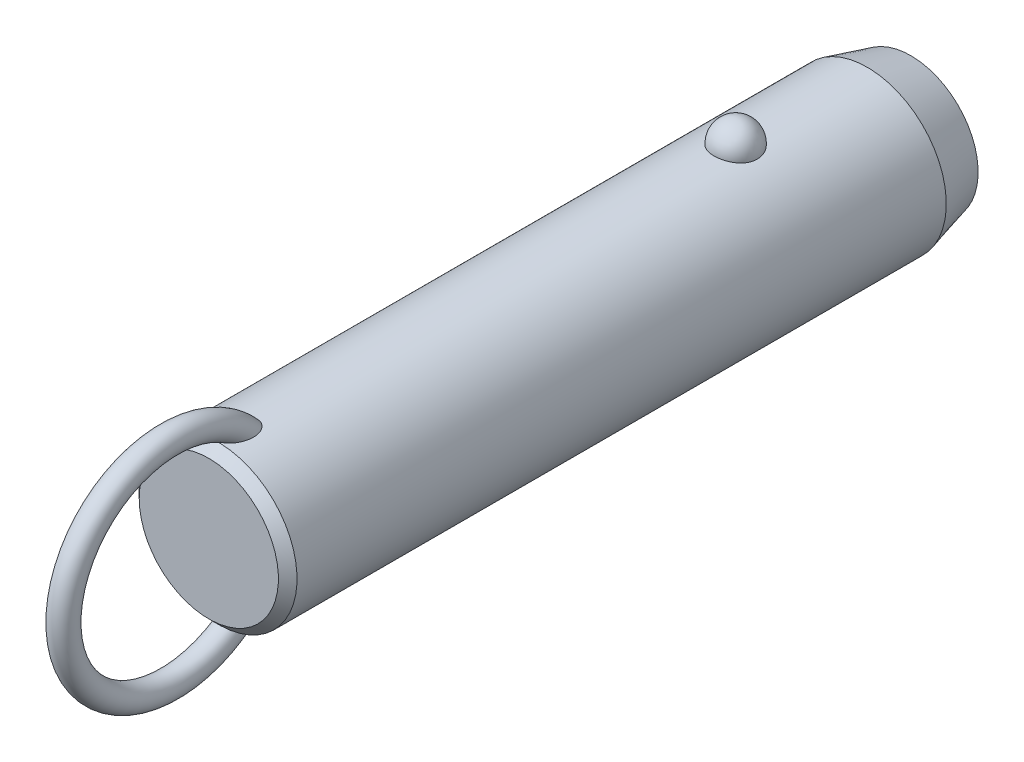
ISO-10303-21;
HEADER;
FILE_DESCRIPTION(('STEP AP214'),'2;1');
FILE_NAME('part.step','',(''),(''),'','','');
FILE_SCHEMA(('AUTOMOTIVE_DESIGN { 1 0 10303 214 1 1 1 1 }'));
ENDSEC;
DATA;
#1=APPLICATION_CONTEXT('core data for automotive mechanical design processes');
#2=APPLICATION_PROTOCOL_DEFINITION('international standard','automotive_design',2000,#1);
#3=PRODUCT_CONTEXT('',#1,'mechanical');
#4=PRODUCT('Part','Part','',(#3));
#5=PRODUCT_RELATED_PRODUCT_CATEGORY('part','',(#4));
#6=PRODUCT_DEFINITION_FORMATION('','',#4);
#7=PRODUCT_DEFINITION_CONTEXT('part definition',#1,'design');
#8=PRODUCT_DEFINITION('design','',#6,#7);
#9=PRODUCT_DEFINITION_SHAPE('','',#8);
#10=(LENGTH_UNIT() NAMED_UNIT(*) SI_UNIT(.MILLI.,.METRE.));
#11=(NAMED_UNIT(*) PLANE_ANGLE_UNIT() SI_UNIT($,.RADIAN.));
#12=(NAMED_UNIT(*) SI_UNIT($,.STERADIAN.) SOLID_ANGLE_UNIT());
#13=UNCERTAINTY_MEASURE_WITH_UNIT(LENGTH_MEASURE(1.E-05),#10,'distance_accuracy_value','');
#14=(GEOMETRIC_REPRESENTATION_CONTEXT(3) GLOBAL_UNCERTAINTY_ASSIGNED_CONTEXT((#13)) GLOBAL_UNIT_ASSIGNED_CONTEXT((#10,
#11,#12)) REPRESENTATION_CONTEXT('',''));
#15=CARTESIAN_POINT('',(0.,0.,0.));
#16=DIRECTION('',(0.,0.,1.));
#17=DIRECTION('',(1.,0.,0.));
#18=AXIS2_PLACEMENT_3D('',#15,#16,#17);
#19=CARTESIAN_POINT('',(0.,0.,68.6));
#20=DIRECTION('',(0.,0.,-1.));
#21=DIRECTION('',(-1.,0.,0.));
#22=AXIS2_PLACEMENT_3D('',#19,#20,#21);
#23=CYLINDRICAL_SURFACE('',#22,12.7);
#24=CARTESIAN_POINT('',(3.46661256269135,12.2177165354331,-3.5));
#25=CARTESIAN_POINT('',(3.4666090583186,12.2177194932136,-3.30432790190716));
#26=CARTESIAN_POINT('',(3.45063567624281,12.2222841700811,-3.10861112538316));
#27=CARTESIAN_POINT('',(3.38712451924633,12.2400345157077,-2.72271899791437));
#28=CARTESIAN_POINT('',(3.33957415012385,12.2532236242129,-2.53254588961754));
#29=CARTESIAN_POINT('',(3.2141234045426,12.286724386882,-2.16324948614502));
#30=CARTESIAN_POINT('',(3.13623639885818,12.3070329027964,-1.98412136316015));
#31=CARTESIAN_POINT('',(2.95205930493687,12.3525018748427,-1.64180592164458));
#32=CARTESIAN_POINT('',(2.84577003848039,12.3776621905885,-1.47861814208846));
#33=CARTESIAN_POINT('',(2.60688050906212,12.4301712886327,-1.17190583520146));
#34=CARTESIAN_POINT('',(2.47415697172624,12.4575299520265,-1.02847897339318));
#35=CARTESIAN_POINT('',(2.18615174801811,12.5112810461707,-0.766177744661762));
#36=CARTESIAN_POINT('',(2.03087002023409,12.5376734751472,-0.64730342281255));
#37=CARTESIAN_POINT('',(1.70237334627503,12.5864761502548,-0.437732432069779));
#38=CARTESIAN_POINT('',(1.52920948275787,12.6088972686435,-0.346958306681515));
#39=CARTESIAN_POINT('',(1.16944170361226,12.6473352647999,-0.195750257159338));
#40=CARTESIAN_POINT('',(0.982839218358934,12.663352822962,-0.135313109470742));
#41=CARTESIAN_POINT('',(0.604961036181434,12.6869706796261,-0.0473241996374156));
#42=CARTESIAN_POINT('',(0.41382314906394,12.6947125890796,-0.0192185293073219));
#43=CARTESIAN_POINT('',(0.0293827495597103,12.7014203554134,0.0051725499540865));
#44=CARTESIAN_POINT('',(-0.163919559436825,12.7003870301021,0.00146092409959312));
#45=CARTESIAN_POINT('',(-0.544374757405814,12.689735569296,-0.0373939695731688));
#46=CARTESIAN_POINT('',(-0.731575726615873,12.6802364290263,-0.0721015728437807));
#47=CARTESIAN_POINT('',(-1.09733277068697,12.6538333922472,-0.171364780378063));
#48=CARTESIAN_POINT('',(-1.27588869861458,12.6369293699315,-0.235920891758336));
#49=CARTESIAN_POINT('',(-1.6204698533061,12.5973946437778,-0.393548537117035));
#50=CARTESIAN_POINT('',(-1.78641865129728,12.5747321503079,-0.486778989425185));
#51=CARTESIAN_POINT('',(-2.10030671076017,12.5261316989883,-0.699110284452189));
#52=CARTESIAN_POINT('',(-2.24824419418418,12.5001934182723,-0.818213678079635));
#53=CARTESIAN_POINT('',(-2.52491489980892,12.4472906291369,-1.08157124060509));
#54=CARTESIAN_POINT('',(-2.65324222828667,12.4203160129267,-1.22624992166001));
#55=CARTESIAN_POINT('',(-2.88410007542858,12.3687509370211,-1.53528325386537));
#56=CARTESIAN_POINT('',(-2.98662883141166,12.3441606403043,-1.69963924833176));
#57=CARTESIAN_POINT('',(-3.16432417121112,12.2998199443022,-2.04548497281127));
#58=CARTESIAN_POINT('',(-3.23917525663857,12.2801261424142,-2.22714424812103));
#59=CARTESIAN_POINT('',(-3.35800573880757,12.248167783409,-2.6009138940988));
#60=CARTESIAN_POINT('',(-3.4019860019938,12.2359030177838,-2.79302397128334));
#61=CARTESIAN_POINT('',(-3.45784812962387,12.2202347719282,-3.18140279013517));
#62=CARTESIAN_POINT('',(-3.46986123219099,12.2167950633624,-3.37765118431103));
#63=CARTESIAN_POINT('',(-3.46186273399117,12.2190638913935,-3.76943689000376));
#64=CARTESIAN_POINT('',(-3.44185196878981,12.2247721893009,-3.96497421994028));
#65=CARTESIAN_POINT('',(-3.37048652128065,12.2446381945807,-4.34881728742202));
#66=CARTESIAN_POINT('',(-3.31928253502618,12.2587552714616,-4.53715319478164));
#67=CARTESIAN_POINT('',(-3.18693461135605,12.2938237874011,-4.90231727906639));
#68=CARTESIAN_POINT('',(-3.1057895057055,12.3147754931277,-5.07914500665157));
#69=CARTESIAN_POINT('',(-2.91506431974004,12.3613125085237,-5.41732059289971));
#70=CARTESIAN_POINT('',(-2.80533587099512,12.3869217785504,-5.57858147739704));
#71=CARTESIAN_POINT('',(-2.560414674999,12.4398525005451,-5.88013283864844));
#72=CARTESIAN_POINT('',(-2.42522099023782,12.4671740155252,-6.02042254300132));
#73=CARTESIAN_POINT('',(-2.1323357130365,12.5205965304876,-6.27662798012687));
#74=CARTESIAN_POINT('',(-1.97456596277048,12.5466928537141,-6.3924554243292));
#75=CARTESIAN_POINT('',(-1.64115839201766,12.5946384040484,-6.59583547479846));
#76=CARTESIAN_POINT('',(-1.46552179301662,12.6164879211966,-6.68339001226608));
#77=CARTESIAN_POINT('',(-1.10356050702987,12.6532533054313,-6.82682153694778));
#78=CARTESIAN_POINT('',(-0.9173913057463,12.6682500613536,-6.8830698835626));
#79=CARTESIAN_POINT('',(-0.537836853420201,12.6900288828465,-6.96386887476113));
#80=CARTESIAN_POINT('',(-0.344452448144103,12.6968119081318,-6.9884232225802));
#81=CARTESIAN_POINT('',(0.0402577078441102,12.7013667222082,-7.00496469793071));
#82=CARTESIAN_POINT('',(0.231556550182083,12.6993008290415,-6.99753844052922));
#83=CARTESIAN_POINT('',(0.610105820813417,12.6867505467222,-6.9516636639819));
#84=CARTESIAN_POINT('',(0.797356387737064,12.6762664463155,-6.913216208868));
#85=CARTESIAN_POINT('',(1.16186657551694,12.6480587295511,-6.80658431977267));
#86=CARTESIAN_POINT('',(1.33915951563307,12.6303611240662,-6.73850666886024));
#87=CARTESIAN_POINT('',(1.67968518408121,12.5896027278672,-6.5745087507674));
#88=CARTESIAN_POINT('',(1.84291705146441,12.5665416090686,-6.47858678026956));
#89=CARTESIAN_POINT('',(2.15340192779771,12.5171072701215,-6.25982455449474));
#90=CARTESIAN_POINT('',(2.30037831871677,12.4906895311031,-6.13660186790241));
#91=CARTESIAN_POINT('',(2.5717412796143,12.4376567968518,-5.86739587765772));
#92=CARTESIAN_POINT('',(2.69612388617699,12.4110417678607,-5.72140858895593));
#93=CARTESIAN_POINT('',(2.92107785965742,12.360051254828,-5.40794137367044));
#94=CARTESIAN_POINT('',(3.02121329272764,12.3357209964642,-5.24014110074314));
#95=CARTESIAN_POINT('',(3.19236291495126,12.2925446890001,-4.88969865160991));
#96=CARTESIAN_POINT('',(3.26338839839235,12.2736965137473,-4.70706226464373));
#97=CARTESIAN_POINT('',(3.36788038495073,12.245404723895,-4.35469510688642));
#98=CARTESIAN_POINT('',(3.40484026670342,12.2351018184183,-4.18605935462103));
#99=CARTESIAN_POINT('',(3.45420764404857,12.2212564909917,-3.84496058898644));
#100=CARTESIAN_POINT('',(3.46661565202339,12.2177139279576,-3.67249765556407));
#101=CARTESIAN_POINT('',(3.46661256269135,12.2177165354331,-3.5));
#102=B_SPLINE_CURVE_WITH_KNOTS('',3,(#24,#25,#26,#27,#28,#29,#30,#31,#32,#33,#34,#35,#36,#37,
#38,#39,#40,#41,#42,#43,#44,#45,#46,#47,#48,#49,#50,#51,#52,#53,#54,#55,#56,#57,#58,#59,#60,#61,
#62,#63,#64,#65,#66,#67,#68,#69,#70,#71,#72,#73,#74,#75,#76,#77,#78,#79,#80,#81,#82,#83,#84,#85,
#86,#87,#88,#89,#90,#91,#92,#93,#94,#95,#96,#97,#98,#99,#100,#101),.UNSPECIFIED.,.T.,.F.,(4,2,2,
2,2,2,2,2,2,2,2,2,2,2,2,2,2,2,2,2,2,2,2,2,2,2,2,2,2,2,2,2,2,2,2,2,2,2,4),(0.,0.586396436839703,
1.17302689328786,1.7593990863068,2.34575431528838,2.93491084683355,3.52406845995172,
4.11158733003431,4.69904375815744,5.2762784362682,5.85345931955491,6.42265312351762,
6.99185659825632,7.56427334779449,8.136746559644,8.71981013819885,9.3029135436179,
9.89247258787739,10.4820150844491,11.0691335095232,11.6562366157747,12.2405256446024,
12.8248374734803,13.412244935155,13.9996740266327,14.5891883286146,15.1786623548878,
15.7609861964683,16.3432419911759,16.9148635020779,17.4864654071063,18.0560241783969,
18.6256177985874,19.2037609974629,19.7820055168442,20.3699810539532,20.957728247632,
21.4746855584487,21.9916320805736),.UNSPECIFIED.);
#103=CARTESIAN_POINT('',(3.46661256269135,12.2177165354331,-3.5));
#104=VERTEX_POINT('',#103);
#105=EDGE_CURVE('E41',#104,#104,#102,.T.);
#106=ORIENTED_EDGE('',*,*,#105,.T.);
#107=EDGE_LOOP('',(#106));
#108=FACE_BOUND('',#107,.T.);
#109=CARTESIAN_POINT('',(0.,0.,79.8));
#110=DIRECTION('',(0.,0.,1.));
#111=DIRECTION('',(1.,0.,0.));
#112=AXIS2_PLACEMENT_3D('',#109,#110,#111);
#113=CIRCLE('',#112,12.7);
#114=CARTESIAN_POINT('',(-12.7,0.,79.8));
#115=VERTEX_POINT('',#114);
#116=EDGE_CURVE('E10',#115,#115,#113,.F.);
#117=ORIENTED_EDGE('',*,*,#116,.T.);
#118=EDGE_LOOP('',(#117));
#119=FACE_BOUND('',#118,.T.);
#120=CARTESIAN_POINT('',(-0.548122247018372,-12.6881662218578,73.5432187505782));
#121=CARTESIAN_POINT('',(-0.648865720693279,-12.6838128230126,73.577926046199));
#122=CARTESIAN_POINT('',(-0.746398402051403,-12.6783867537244,73.6220428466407));
#123=CARTESIAN_POINT('',(-0.93212506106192,-12.666091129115,73.7267647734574));
#124=CARTESIAN_POINT('',(-1.02030388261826,-12.6592192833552,73.787396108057));
#125=CARTESIAN_POINT('',(-1.18487740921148,-12.6448747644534,73.921847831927));
#126=CARTESIAN_POINT('',(-1.26134296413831,-12.637406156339,73.9955825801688));
#127=CARTESIAN_POINT('',(-1.4023120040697,-12.6225412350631,74.1536045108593));
#128=CARTESIAN_POINT('',(-1.46681470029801,-12.6151449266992,74.2378923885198));
#129=CARTESIAN_POINT('',(-1.60714786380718,-12.5981718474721,74.4496577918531));
#130=CARTESIAN_POINT('',(-1.67725126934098,-12.588900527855,74.5809624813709));
#131=CARTESIAN_POINT('',(-1.79536591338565,-12.5725964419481,74.8532471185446));
#132=CARTESIAN_POINT('',(-1.84333535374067,-12.5655679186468,74.9942447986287));
#133=CARTESIAN_POINT('',(-1.93422576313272,-12.5519624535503,75.3376455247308));
#134=CARTESIAN_POINT('',(-1.96788773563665,-12.5466298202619,75.5425578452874));
#135=CARTESIAN_POINT('',(-1.9941399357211,-12.542463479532,75.8517600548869));
#136=CARTESIAN_POINT('',(-1.99883864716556,-12.5417153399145,75.9552987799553));
#137=CARTESIAN_POINT('',(-2.00078003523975,-12.5414074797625,76.1624512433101));
#138=CARTESIAN_POINT('',(-1.99802449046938,-12.5418474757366,76.2660649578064));
#139=CARTESIAN_POINT('',(-1.98336733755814,-12.5441750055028,76.5103207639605));
#140=CARTESIAN_POINT('',(-1.96851430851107,-12.5465291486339,76.6507804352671));
#141=CARTESIAN_POINT('',(-1.92707089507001,-12.5529612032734,76.9299607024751));
#142=CARTESIAN_POINT('',(-1.90047458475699,-12.5570399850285,77.0686803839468));
#143=CARTESIAN_POINT('',(-1.83619120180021,-12.5666008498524,77.3434113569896));
#144=CARTESIAN_POINT('',(-1.79850828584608,-12.57208240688,77.4794236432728));
#145=CARTESIAN_POINT('',(-1.71223796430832,-12.5841228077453,77.7478421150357));
#146=CARTESIAN_POINT('',(-1.66365679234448,-12.5906810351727,77.8802503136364));
#147=CARTESIAN_POINT('',(-1.5780450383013,-12.6016176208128,78.0854887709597));
#148=CARTESIAN_POINT('',(-1.54477252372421,-12.6057501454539,78.1599149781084));
#149=CARTESIAN_POINT('',(-1.47424480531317,-12.6141930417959,78.3068393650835));
#150=CARTESIAN_POINT('',(-1.43699041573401,-12.6185033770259,78.3793379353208));
#151=CARTESIAN_POINT('',(-1.35825795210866,-12.6272207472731,78.5218926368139));
#152=CARTESIAN_POINT('',(-1.31678520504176,-12.6316276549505,78.5919517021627));
#153=CARTESIAN_POINT('',(-1.22917793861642,-12.6404532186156,78.7290705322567));
#154=CARTESIAN_POINT('',(-1.18304514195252,-12.6448718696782,78.7961313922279));
#155=CARTESIAN_POINT('',(-1.07246411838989,-12.6547893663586,78.9438741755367));
#156=CARTESIAN_POINT('',(-1.00642239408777,-12.6602600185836,79.0233844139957));
#157=CARTESIAN_POINT('',(-0.864441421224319,-12.6707460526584,79.1731698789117));
#158=CARTESIAN_POINT('',(-0.788516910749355,-12.6757620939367,79.2434585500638));
#159=CARTESIAN_POINT('',(-0.652215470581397,-12.6833591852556,79.3486801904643));
#160=CARTESIAN_POINT('',(-0.594982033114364,-12.6861973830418,79.3876241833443));
#161=CARTESIAN_POINT('',(-0.475269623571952,-12.6912445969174,79.4564899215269));
#162=CARTESIAN_POINT('',(-0.412800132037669,-12.6934547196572,79.4864275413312));
#163=CARTESIAN_POINT('',(-0.295749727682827,-12.6966636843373,79.5297565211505));
#164=CARTESIAN_POINT('',(-0.241949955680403,-12.6978134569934,79.5452188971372));
#165=CARTESIAN_POINT('',(-0.132508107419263,-12.6994261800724,79.5668845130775));
#166=CARTESIAN_POINT('',(-0.0768679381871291,-12.6998898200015,79.5730970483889));
#167=CARTESIAN_POINT('',(0.0347696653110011,-12.7000752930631,79.5755838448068));
#168=CARTESIAN_POINT('',(0.0907676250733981,-12.6997954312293,79.5718353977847));
#169=CARTESIAN_POINT('',(0.201283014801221,-12.6985255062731,79.5547883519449));
#170=CARTESIAN_POINT('',(0.255799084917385,-12.6975348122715,79.5414812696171));
#171=CARTESIAN_POINT('',(0.376042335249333,-12.6946091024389,79.5020379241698));
#172=CARTESIAN_POINT('',(0.44095085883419,-12.6924943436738,79.4734492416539));
#173=CARTESIAN_POINT('',(0.565350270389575,-12.6875639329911,79.4063234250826));
#174=CARTESIAN_POINT('',(0.624828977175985,-12.6847467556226,79.3677646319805));
#175=CARTESIAN_POINT('',(0.774116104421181,-12.6767252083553,79.256949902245));
#176=CARTESIAN_POINT('',(0.859449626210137,-12.6711344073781,79.1787605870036));
#177=CARTESIAN_POINT('',(1.01789440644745,-12.6593922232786,79.010943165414));
#178=CARTESIAN_POINT('',(1.09096902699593,-12.653239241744,78.921282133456));
#179=CARTESIAN_POINT('',(1.22268793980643,-12.6411674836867,78.740265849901));
#180=CARTESIAN_POINT('',(1.28193986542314,-12.6352572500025,78.649345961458));
#181=CARTESIAN_POINT('',(1.39259777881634,-12.6235401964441,78.4627929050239));
#182=CARTESIAN_POINT('',(1.44399707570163,-12.6177334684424,78.3671558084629));
#183=CARTESIAN_POINT('',(1.53972870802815,-12.6064093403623,78.1722738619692));
#184=CARTESIAN_POINT('',(1.58405262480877,-12.6008922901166,78.0730248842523));
#185=CARTESIAN_POINT('',(1.66600705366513,-12.5903187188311,77.8717727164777));
#186=CARTESIAN_POINT('',(1.70363651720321,-12.5852622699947,77.7697690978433));
#187=CARTESIAN_POINT('',(1.77545379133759,-12.5753406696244,77.5543580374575));
#188=CARTESIAN_POINT('',(1.80903453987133,-12.5705328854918,77.440745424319));
#189=CARTESIAN_POINT('',(1.86844163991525,-12.5618400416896,77.2114575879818));
#190=CARTESIAN_POINT('',(1.89426665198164,-12.5579551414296,77.0957820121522));
#191=CARTESIAN_POINT('',(1.9378546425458,-12.5513030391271,76.8630072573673));
#192=CARTESIAN_POINT('',(1.9556264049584,-12.5485346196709,76.7459097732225));
#193=CARTESIAN_POINT('',(1.98264463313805,-12.5442934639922,76.5107473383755));
#194=CARTESIAN_POINT('',(1.99189298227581,-12.5428204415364,76.3926826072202));
#195=CARTESIAN_POINT('',(2.00416068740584,-12.540871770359,76.0806225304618));
#196=CARTESIAN_POINT('',(1.99944433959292,-12.541631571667,75.8862290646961));
#197=CARTESIAN_POINT('',(1.96113755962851,-12.5476846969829,75.5003095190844));
#198=CARTESIAN_POINT('',(1.92758341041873,-12.5529723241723,75.3087801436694));
#199=CARTESIAN_POINT('',(1.83934342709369,-12.5661532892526,74.9822728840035));
#200=CARTESIAN_POINT('',(1.79215440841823,-12.5730485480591,74.8452499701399));
#201=CARTESIAN_POINT('',(1.67676242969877,-12.588958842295,74.5804459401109));
#202=CARTESIAN_POINT('',(1.60859050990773,-12.597970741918,74.4526515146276));
#203=CARTESIAN_POINT('',(1.46583832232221,-12.6152829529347,74.2358006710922));
#204=CARTESIAN_POINT('',(1.39525727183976,-12.6233659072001,74.1441050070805));
#205=CARTESIAN_POINT('',(1.23992594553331,-12.6395676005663,73.9734854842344));
#206=CARTESIAN_POINT('',(1.1551793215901,-12.6476863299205,73.8945583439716));
#207=CARTESIAN_POINT('',(0.971995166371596,-12.6630846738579,73.7526438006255));
#208=CARTESIAN_POINT('',(0.873456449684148,-12.6703572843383,73.6897849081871));
#209=CARTESIAN_POINT('',(0.665847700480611,-12.6829569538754,73.5844870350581));
#210=CARTESIAN_POINT('',(0.556784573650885,-12.688285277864,73.5420347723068));
#211=CARTESIAN_POINT('',(0.347338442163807,-12.6956226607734,73.4844434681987));
#212=CARTESIAN_POINT('',(0.247759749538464,-12.6979816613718,73.4663996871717));
#213=CARTESIAN_POINT('',(0.0470218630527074,-12.7003077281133,73.448600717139));
#214=CARTESIAN_POINT('',(-0.0541350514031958,-12.7002779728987,73.4488212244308));
#215=CARTESIAN_POINT('',(-0.221414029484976,-12.6982482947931,73.4643639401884));
#216=CARTESIAN_POINT('',(-0.288055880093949,-12.6969033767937,73.4746662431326));
#217=CARTESIAN_POINT('',(-0.419599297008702,-12.6932369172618,73.5031348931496));
#218=CARTESIAN_POINT('',(-0.484501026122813,-12.6909154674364,73.5213005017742));
#219=CARTESIAN_POINT('',(-0.548122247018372,-12.6881662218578,73.5432187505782));
#220=B_SPLINE_CURVE_WITH_KNOTS('',3,(#120,#121,#122,#123,#124,#125,#126,#127,#128,#129,#130,
#131,#132,#133,#134,#135,#136,#137,#138,#139,#140,#141,#142,#143,#144,#145,#146,#147,#148,#149,
#150,#151,#152,#153,#154,#155,#156,#157,#158,#159,#160,#161,#162,#163,#164,#165,#166,#167,#168,
#169,#170,#171,#172,#173,#174,#175,#176,#177,#178,#179,#180,#181,#182,#183,#184,#185,#186,#187,
#188,#189,#190,#191,#192,#193,#194,#195,#196,#197,#198,#199,#200,#201,#202,#203,#204,#205,#206,
#207,#208,#209,#210,#211,#212,#213,#214,#215,#216,#217,#218,#219),.UNSPECIFIED.,.T.,.F.,(4,2,2,
2,2,2,2,2,2,2,2,2,2,2,2,2,2,2,2,2,2,2,2,2,2,2,2,2,2,2,2,2,2,2,2,2,2,2,2,2,2,2,2,2,2,2,2,2,2,4),
(0.,0.31964225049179,0.639794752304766,0.957927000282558,1.27608021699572,1.72100165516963,
2.16675988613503,2.78630021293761,3.0970578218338,3.40774128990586,3.83096358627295,
4.2543996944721,4.67767724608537,5.10071330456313,5.34550297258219,5.59024267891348,
5.83467707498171,6.07902143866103,6.38891080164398,6.69834321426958,6.90560910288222,
7.11250749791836,7.27977315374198,7.44687060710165,7.61434932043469,7.78197685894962,
7.99365544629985,8.20579780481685,8.55147335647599,8.89816429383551,9.22375138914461,
9.5496143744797,9.87586224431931,10.202161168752,10.557587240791,10.9130746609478,
11.2681734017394,11.6231936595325,12.2046601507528,12.7853961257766,13.219164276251,
13.6522938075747,13.9989174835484,14.3454519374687,14.6946768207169,15.0436740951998,
15.3457513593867,15.6474266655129,15.8493051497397,16.0511646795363),.UNSPECIFIED.);
#221=CARTESIAN_POINT('',(-0.548122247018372,-12.6881662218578,73.5432187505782));
#222=VERTEX_POINT('',#221);
#223=EDGE_CURVE('E59',#222,#222,#220,.T.);
#224=ORIENTED_EDGE('',*,*,#223,.T.);
#225=EDGE_LOOP('',(#224));
#226=FACE_BOUND('',#225,.T.);
#227=CARTESIAN_POINT('',(-0.548122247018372,12.6881662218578,73.5432187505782));
#228=CARTESIAN_POINT('',(-0.459436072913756,12.6919968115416,73.512673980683));
#229=CARTESIAN_POINT('',(-0.368189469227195,12.6949996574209,73.4893913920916));
#230=CARTESIAN_POINT('',(-0.183024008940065,12.6990186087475,73.4584062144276));
#231=CARTESIAN_POINT('',(-0.0891049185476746,12.7000345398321,73.4507049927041));
#232=CARTESIAN_POINT('',(0.0987147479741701,12.6999636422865,73.4512455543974));
#233=CARTESIAN_POINT('',(0.192615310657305,12.6988761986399,73.4594920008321));
#234=CARTESIAN_POINT('',(0.377658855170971,12.6947211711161,73.4915515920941));
#235=CARTESIAN_POINT('',(0.468801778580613,12.6916535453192,73.5153650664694));
#236=CARTESIAN_POINT('',(0.645809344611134,12.6838788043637,73.5774565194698));
#237=CARTESIAN_POINT('',(0.731679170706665,12.6791733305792,73.615720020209));
#238=CARTESIAN_POINT('',(0.896315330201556,12.6686004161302,73.705120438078));
#239=CARTESIAN_POINT('',(0.975080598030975,12.6627328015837,73.7562592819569));
#240=CARTESIAN_POINT('',(1.12963655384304,12.6499161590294,73.8736782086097));
#241=CARTESIAN_POINT('',(1.20478673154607,12.6429194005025,73.9407929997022));
#242=CARTESIAN_POINT('',(1.34448241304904,12.6288282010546,74.0852250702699));
#243=CARTESIAN_POINT('',(1.40902173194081,12.621733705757,74.1625482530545));
#244=CARTESIAN_POINT('',(1.55208211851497,12.6050877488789,74.3592475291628));
#245=CARTESIAN_POINT('',(1.62510490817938,12.5957546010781,74.4826540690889));
#246=CARTESIAN_POINT('',(1.75019044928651,12.5789823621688,74.7397690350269));
#247=CARTESIAN_POINT('',(1.80221377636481,12.5715468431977,74.873496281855));
#248=CARTESIAN_POINT('',(1.90309965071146,12.5567434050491,75.1983516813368));
#249=CARTESIAN_POINT('',(1.94342317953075,12.5504515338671,75.3921611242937));
#250=CARTESIAN_POINT('',(1.99332997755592,12.5426147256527,75.7837881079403));
#251=CARTESIAN_POINT('',(2.00285305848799,12.5410790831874,75.9816127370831));
#252=CARTESIAN_POINT('',(1.99678999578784,12.5420407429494,76.3166427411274));
#253=CARTESIAN_POINT('',(1.98794117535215,12.5434564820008,76.4540428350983));
#254=CARTESIAN_POINT('',(1.95865119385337,12.5480641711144,76.7276394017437));
#255=CARTESIAN_POINT('',(1.93820436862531,12.5512569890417,76.8638352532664));
#256=CARTESIAN_POINT('',(1.88647896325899,12.5591352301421,77.1342493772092));
#257=CARTESIAN_POINT('',(1.85518800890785,12.5638223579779,77.2684652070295));
#258=CARTESIAN_POINT('',(1.78217886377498,12.5743868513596,77.5339362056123));
#259=CARTESIAN_POINT('',(1.74046509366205,12.5802637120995,77.6651926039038));
#260=CARTESIAN_POINT('',(1.66024095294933,12.5910571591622,77.8860855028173));
#261=CARTESIAN_POINT('',(1.62434772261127,12.5957535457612,77.9766904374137));
#262=CARTESIAN_POINT('',(1.5470900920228,12.6054762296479,78.1555125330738));
#263=CARTESIAN_POINT('',(1.50572681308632,12.6105024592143,78.2437301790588));
#264=CARTESIAN_POINT('',(1.41728020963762,12.620748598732,78.4169321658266));
#265=CARTESIAN_POINT('',(1.37021377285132,12.625967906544,78.5019251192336));
#266=CARTESIAN_POINT('',(1.2696962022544,12.6364721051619,78.6680072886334));
#267=CARTESIAN_POINT('',(1.21624929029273,12.6417569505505,78.7490990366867));
#268=CARTESIAN_POINT('',(1.10304413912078,12.6521331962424,78.9047027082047));
#269=CARTESIAN_POINT('',(1.04340936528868,12.657226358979,78.9793033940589));
#270=CARTESIAN_POINT('',(0.91591933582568,12.6670906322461,79.121324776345));
#271=CARTESIAN_POINT('',(0.84806456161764,12.6718617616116,79.1887458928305));
#272=CARTESIAN_POINT('',(0.717035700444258,12.67987711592,79.3006247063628));
#273=CARTESIAN_POINT('',(0.655526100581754,12.6832377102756,79.3469970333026));
#274=CARTESIAN_POINT('',(0.525985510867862,12.6892676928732,79.4296195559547));
#275=CARTESIAN_POINT('',(0.45796984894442,12.6919386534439,79.4658927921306));
#276=CARTESIAN_POINT('',(0.334859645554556,12.695691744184,79.5166572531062));
#277=CARTESIAN_POINT('',(0.281116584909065,12.6970073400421,79.5343733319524));
#278=CARTESIAN_POINT('',(0.171425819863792,12.6989609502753,79.5606429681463));
#279=CARTESIAN_POINT('',(0.11548082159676,12.699599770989,79.5692074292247));
#280=CARTESIAN_POINT('',(0.00272618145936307,12.7001251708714,79.5762531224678));
#281=CARTESIAN_POINT('',(-0.0540859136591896,12.7000089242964,79.5746964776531));
#282=CARTESIAN_POINT('',(-0.166544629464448,12.6990328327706,79.5616005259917));
#283=CARTESIAN_POINT('',(-0.222190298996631,12.6981724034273,79.5500533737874));
#284=CARTESIAN_POINT('',(-0.342018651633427,12.695562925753,79.5149128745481));
#285=CARTESIAN_POINT('',(-0.405606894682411,12.6936676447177,79.4893322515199));
#286=CARTESIAN_POINT('',(-0.527815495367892,12.6891754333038,79.4283111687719));
#287=CARTESIAN_POINT('',(-0.586425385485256,12.6865770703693,79.3928505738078));
#288=CARTESIAN_POINT('',(-0.731842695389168,12.6792129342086,79.2914960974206));
#289=CARTESIAN_POINT('',(-0.814709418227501,12.6740767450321,79.2200395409));
#290=CARTESIAN_POINT('',(-0.969101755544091,12.6632083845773,79.0658900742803));
#291=CARTESIAN_POINT('',(-1.04059564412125,12.6574746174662,78.9831668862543));
#292=CARTESIAN_POINT('',(-1.16981116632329,12.6461638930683,78.8158096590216));
#293=CARTESIAN_POINT('',(-1.22811369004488,12.6405994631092,78.7316166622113));
#294=CARTESIAN_POINT('',(-1.33743405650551,12.6295007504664,78.5585791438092));
#295=CARTESIAN_POINT('',(-1.38844577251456,12.6239664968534,78.4697307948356));
#296=CARTESIAN_POINT('',(-1.4840070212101,12.6130898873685,78.288389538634));
#297=CARTESIAN_POINT('',(-1.52854232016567,12.6077479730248,78.1958891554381));
#298=CARTESIAN_POINT('',(-1.6115011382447,12.5974127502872,78.0081607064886));
#299=CARTESIAN_POINT('',(-1.64992317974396,12.5924195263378,77.9129319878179));
#300=CARTESIAN_POINT('',(-1.73468589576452,12.581070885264,77.6828936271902));
#301=CARTESIAN_POINT('',(-1.77831261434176,12.5749388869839,77.5470661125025));
#302=CARTESIAN_POINT('',(-1.85439734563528,12.5639437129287,77.2722128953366));
#303=CARTESIAN_POINT('',(-1.88684994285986,12.5590811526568,77.1331856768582));
#304=CARTESIAN_POINT('',(-1.94008483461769,12.550968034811,76.8530923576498));
#305=CARTESIAN_POINT('',(-1.96088706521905,12.5477147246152,76.7120301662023));
#306=CARTESIAN_POINT('',(-1.99000539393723,12.5431291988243,76.4286689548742));
#307=CARTESIAN_POINT('',(-1.99832911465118,12.5417958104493,76.2863707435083));
#308=CARTESIAN_POINT('',(-2.00166624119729,12.5412674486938,75.9576271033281));
#309=CARTESIAN_POINT('',(-1.99178843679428,12.5428579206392,75.771088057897));
#310=CARTESIAN_POINT('',(-1.9445518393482,12.5502731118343,75.4016240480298));
#311=CARTESIAN_POINT('',(-1.90724032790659,12.5560905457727,75.2186934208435));
#312=CARTESIAN_POINT('',(-1.81330718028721,12.5699462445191,74.9048488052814));
#313=CARTESIAN_POINT('',(-1.76338820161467,12.5771273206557,74.7719105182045));
#314=CARTESIAN_POINT('',(-1.64305018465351,12.593414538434,74.5156813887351));
#315=CARTESIAN_POINT('',(-1.57265346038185,12.6025185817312,74.392380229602));
#316=CARTESIAN_POINT('',(-1.42634956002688,12.6198178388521,74.1835648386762));
#317=CARTESIAN_POINT('',(-1.35423772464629,12.6278405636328,74.0953846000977));
#318=CARTESIAN_POINT('',(-1.19645664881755,12.6437632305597,73.9321079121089));
#319=CARTESIAN_POINT('',(-1.11080536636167,12.6516633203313,73.8569944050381));
#320=CARTESIAN_POINT('',(-0.947219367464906,12.6648319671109,73.7378114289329));
#321=CARTESIAN_POINT('',(-0.871624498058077,12.670300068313,73.6905414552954));
#322=CARTESIAN_POINT('',(-0.714161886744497,12.6801492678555,73.6077413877));
#323=CARTESIAN_POINT('',(-0.632295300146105,12.684530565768,73.5722091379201));
#324=CARTESIAN_POINT('',(-0.548122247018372,12.6881662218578,73.5432187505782));
#325=B_SPLINE_CURVE_WITH_KNOTS('',3,(#227,#228,#229,#230,#231,#232,#233,#234,#235,#236,#237,
#238,#239,#240,#241,#242,#243,#244,#245,#246,#247,#248,#249,#250,#251,#252,#253,#254,#255,#256,
#257,#258,#259,#260,#261,#262,#263,#264,#265,#266,#267,#268,#269,#270,#271,#272,#273,#274,#275,
#276,#277,#278,#279,#280,#281,#282,#283,#284,#285,#286,#287,#288,#289,#290,#291,#292,#293,#294,
#295,#296,#297,#298,#299,#300,#301,#302,#303,#304,#305,#306,#307,#308,#309,#310,#311,#312,#313,
#314,#315,#316,#317,#318,#319,#320,#321,#322,#323,#324),.UNSPECIFIED.,.T.,.F.,(4,2,2,2,2,2,2,2,
2,2,2,2,2,2,2,2,2,2,2,2,2,2,2,2,2,2,2,2,2,2,2,2,2,2,2,2,2,2,2,2,2,2,2,2,2,2,2,2,4),(0.,
0.281328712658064,0.562682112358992,0.844117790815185,1.12555942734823,1.40671982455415,
1.68792232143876,1.98972294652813,2.29169886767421,2.72039860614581,3.14989948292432,
3.74084916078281,4.33295293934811,4.74554109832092,5.15833092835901,5.57159335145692,
5.98468079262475,6.2772277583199,6.56971484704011,6.86135609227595,7.15280542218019,
7.43927407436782,7.72572595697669,7.95635862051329,8.18646071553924,8.35559393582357,
8.52452541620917,8.69408946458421,8.86378678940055,9.06834348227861,9.27332014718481,
9.60010414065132,9.92778432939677,10.2350252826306,10.5425229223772,10.8506864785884,
11.1589244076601,11.5867893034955,12.0148612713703,12.4421984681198,12.8692745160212,
13.4279365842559,13.9856380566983,14.4107062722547,14.8353130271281,15.1765567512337,
15.5173516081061,15.7844129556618,16.051425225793),.UNSPECIFIED.);
#326=CARTESIAN_POINT('',(-0.548122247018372,12.6881662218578,73.5432187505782));
#327=VERTEX_POINT('',#326);
#328=EDGE_CURVE('E67',#327,#327,#325,.T.);
#329=ORIENTED_EDGE('',*,*,#328,.T.);
#330=EDGE_LOOP('',(#329));
#331=FACE_BOUND('',#330,.T.);
#332=CARTESIAN_POINT('',(0.,0.,-24.6999999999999));
#333=DIRECTION('',(0.,0.,-1.));
#334=DIRECTION('',(-1.,0.,0.));
#335=AXIS2_PLACEMENT_3D('',#332,#333,#334);
#336=CIRCLE('',#335,12.7);
#337=CARTESIAN_POINT('',(-12.7,0.,-24.6999999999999));
#338=VERTEX_POINT('',#337);
#339=EDGE_CURVE('E56',#338,#338,#336,.F.);
#340=ORIENTED_EDGE('',*,*,#339,.T.);
#341=EDGE_LOOP('',(#340));
#342=FACE_BOUND('',#341,.T.);
#343=ADVANCED_FACE('F37',(#108,#119,#226,#331,#342),#23,.T.);
#344=CARTESIAN_POINT('',(0.,0.,-31.7));
#345=DIRECTION('',(0.,0.,-1.));
#346=DIRECTION('',(-1.,0.,0.));
#347=AXIS2_PLACEMENT_3D('',#344,#345,#346);
#348=PLANE('',#347);
#349=CARTESIAN_POINT('',(0.,0.,-31.7));
#350=DIRECTION('',(0.,0.,-1.));
#351=DIRECTION('',(-1.,0.,0.));
#352=AXIS2_PLACEMENT_3D('',#349,#350,#351);
#353=CIRCLE('',#352,10.8243556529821);
#354=CARTESIAN_POINT('',(-10.8243556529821,0.,-31.7));
#355=VERTEX_POINT('',#354);
#356=EDGE_CURVE('E66',#355,#355,#353,.T.);
#357=ORIENTED_EDGE('',*,*,#356,.T.);
#358=EDGE_LOOP('',(#357));
#359=FACE_BOUND('',#358,.T.);
#360=ADVANCED_FACE('F85',(#359),#348,.T.);
#361=CARTESIAN_POINT('',(0.,0.,-31.7));
#362=DIRECTION('',(0.,0.,1.));
#363=DIRECTION('',(1.,0.,0.));
#364=AXIS2_PLACEMENT_3D('',#361,#362,#363);
#365=CONICAL_SURFACE('',#364,10.8243556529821,0.261799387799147);
#366=ORIENTED_EDGE('',*,*,#339,.F.);
#367=EDGE_LOOP('',(#366));
#368=FACE_BOUND('',#367,.T.);
#369=ORIENTED_EDGE('',*,*,#356,.F.);
#370=EDGE_LOOP('',(#369));
#371=FACE_BOUND('',#370,.T.);
#372=ADVANCED_FACE('F83',(#368,#371),#365,.T.);
#373=CARTESIAN_POINT('',(0.,0.,81.3));
#374=DIRECTION('',(0.,0.,1.));
#375=DIRECTION('',(1.,0.,0.));
#376=AXIS2_PLACEMENT_3D('',#373,#374,#375);
#377=PLANE('',#376);
#378=CARTESIAN_POINT('',(0.,0.,81.3));
#379=DIRECTION('',(0.,0.,1.));
#380=DIRECTION('',(1.,0.,0.));
#381=AXIS2_PLACEMENT_3D('',#378,#379,#380);
#382=CIRCLE('',#381,11.2);
#383=CARTESIAN_POINT('',(-11.2,0.,81.3));
#384=VERTEX_POINT('',#383);
#385=EDGE_CURVE('E50',#384,#384,#382,.T.);
#386=ORIENTED_EDGE('',*,*,#385,.T.);
#387=EDGE_LOOP('',(#386));
#388=FACE_BOUND('',#387,.T.);
#389=ADVANCED_FACE('F77',(#388),#377,.T.);
#390=CARTESIAN_POINT('',(0.,0.,87.65));
#391=DIRECTION('',(1.,0.,0.));
#392=DIRECTION('',(0.,0.,-1.));
#393=AXIS2_PLACEMENT_3D('',#390,#391,#392);
#394=TOROIDAL_SURFACE('',#393,17.05,2.);
#395=ORIENTED_EDGE('',*,*,#328,.F.);
#396=EDGE_LOOP('',(#395));
#397=FACE_BOUND('',#396,.T.);
#398=ORIENTED_EDGE('',*,*,#223,.F.);
#399=EDGE_LOOP('',(#398));
#400=FACE_BOUND('',#399,.T.);
#401=ADVANCED_FACE('F73',(#397,#400),#394,.T.);
#402=CARTESIAN_POINT('',(0.,0.,81.3));
#403=DIRECTION('',(0.,0.,-1.));
#404=DIRECTION('',(-1.,0.,0.));
#405=AXIS2_PLACEMENT_3D('',#402,#403,#404);
#406=CONICAL_SURFACE('',#405,11.2,0.785398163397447);
#407=CARTESIAN_POINT('',(-12.7,0.,79.8));
#408=CARTESIAN_POINT('',(-12.684375,0.,79.815625));
#409=CARTESIAN_POINT('',(-12.66875,0.,79.83125));
#410=CARTESIAN_POINT('',(-12.6375,0.,79.8625));
#411=CARTESIAN_POINT('',(-12.621875,0.,79.878125));
#412=CARTESIAN_POINT('',(-12.590625,0.,79.909375));
#413=CARTESIAN_POINT('',(-12.575,0.,79.925));
#414=CARTESIAN_POINT('',(-12.54375,0.,79.95625));
#415=CARTESIAN_POINT('',(-12.528125,0.,79.971875));
#416=CARTESIAN_POINT('',(-12.496875,0.,80.003125));
#417=CARTESIAN_POINT('',(-12.48125,0.,80.01875));
#418=CARTESIAN_POINT('',(-12.45,0.,80.05));
#419=CARTESIAN_POINT('',(-12.434375,0.,80.065625));
#420=CARTESIAN_POINT('',(-12.403125,0.,80.096875));
#421=CARTESIAN_POINT('',(-12.3875,0.,80.1125));
#422=CARTESIAN_POINT('',(-12.35625,0.,80.14375));
#423=CARTESIAN_POINT('',(-12.340625,0.,80.159375));
#424=CARTESIAN_POINT('',(-12.309375,0.,80.190625));
#425=CARTESIAN_POINT('',(-12.29375,0.,80.20625));
#426=CARTESIAN_POINT('',(-12.2625,0.,80.2375));
#427=CARTESIAN_POINT('',(-12.246875,0.,80.253125));
#428=CARTESIAN_POINT('',(-12.215625,0.,80.284375));
#429=CARTESIAN_POINT('',(-12.2,0.,80.3));
#430=CARTESIAN_POINT('',(-12.16875,0.,80.33125));
#431=CARTESIAN_POINT('',(-12.153125,0.,80.346875));
#432=CARTESIAN_POINT('',(-12.121875,0.,80.378125));
#433=CARTESIAN_POINT('',(-12.10625,0.,80.39375));
#434=CARTESIAN_POINT('',(-12.075,0.,80.425));
#435=CARTESIAN_POINT('',(-12.059375,0.,80.440625));
#436=CARTESIAN_POINT('',(-12.028125,0.,80.471875));
#437=CARTESIAN_POINT('',(-12.0125,0.,80.4875));
#438=CARTESIAN_POINT('',(-11.98125,0.,80.51875));
#439=CARTESIAN_POINT('',(-11.965625,0.,80.534375));
#440=CARTESIAN_POINT('',(-11.934375,0.,80.565625));
#441=CARTESIAN_POINT('',(-11.91875,0.,80.58125));
#442=CARTESIAN_POINT('',(-11.8875,0.,80.6125));
#443=CARTESIAN_POINT('',(-11.871875,0.,80.628125));
#444=CARTESIAN_POINT('',(-11.840625,0.,80.659375));
#445=CARTESIAN_POINT('',(-11.825,0.,80.675));
#446=CARTESIAN_POINT('',(-11.79375,0.,80.70625));
#447=CARTESIAN_POINT('',(-11.778125,0.,80.721875));
#448=CARTESIAN_POINT('',(-11.746875,0.,80.753125));
#449=CARTESIAN_POINT('',(-11.73125,0.,80.76875));
#450=CARTESIAN_POINT('',(-11.7,0.,80.8));
#451=CARTESIAN_POINT('',(-11.684375,0.,80.815625));
#452=CARTESIAN_POINT('',(-11.653125,0.,80.846875));
#453=CARTESIAN_POINT('',(-11.6375,0.,80.8625));
#454=CARTESIAN_POINT('',(-11.60625,0.,80.89375));
#455=CARTESIAN_POINT('',(-11.590625,0.,80.909375));
#456=CARTESIAN_POINT('',(-11.559375,0.,80.940625));
#457=CARTESIAN_POINT('',(-11.54375,0.,80.95625));
#458=CARTESIAN_POINT('',(-11.5125,0.,80.9875));
#459=CARTESIAN_POINT('',(-11.496875,0.,81.003125));
#460=CARTESIAN_POINT('',(-11.465625,0.,81.034375));
#461=CARTESIAN_POINT('',(-11.45,0.,81.05));
#462=CARTESIAN_POINT('',(-11.41875,0.,81.08125));
#463=CARTESIAN_POINT('',(-11.403125,0.,81.096875));
#464=CARTESIAN_POINT('',(-11.371875,0.,81.128125));
#465=CARTESIAN_POINT('',(-11.35625,0.,81.14375));
#466=CARTESIAN_POINT('',(-11.325,0.,81.175));
#467=CARTESIAN_POINT('',(-11.309375,0.,81.190625));
#468=CARTESIAN_POINT('',(-11.278125,0.,81.221875));
#469=CARTESIAN_POINT('',(-11.2625,0.,81.2375));
#470=CARTESIAN_POINT('',(-11.23125,0.,81.26875));
#471=CARTESIAN_POINT('',(-11.215625,0.,81.284375));
#472=CARTESIAN_POINT('',(-11.2,0.,81.3));
#473=B_SPLINE_CURVE_WITH_KNOTS('',3,(#407,#408,#409,#410,#411,#412,#413,#414,#415,#416,#417,
#418,#419,#420,#421,#422,#423,#424,#425,#426,#427,#428,#429,#430,#431,#432,#433,#434,#435,#436,
#437,#438,#439,#440,#441,#442,#443,#444,#445,#446,#447,#448,#449,#450,#451,#452,#453,#454,#455,
#456,#457,#458,#459,#460,#461,#462,#463,#464,#465,#466,#467,#468,#469,#470,#471,#472),
.UNSPECIFIED.,.F.,.F.,(4,2,2,2,2,2,2,2,2,2,2,2,2,2,2,2,2,2,2,2,2,2,2,2,2,2,2,2,2,2,2,2,4),(0.,
0.0662912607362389,0.132582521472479,0.198873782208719,0.265165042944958,0.331456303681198,
0.397747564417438,0.464038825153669,0.530330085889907,0.596621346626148,0.662912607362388,
0.729203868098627,0.795495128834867,0.861786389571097,0.928077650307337,0.994368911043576,
1.06066017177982,1.12695143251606,1.1932426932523,1.25953395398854,1.32582521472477,
1.392116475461,1.45840773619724,1.52469899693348,1.59099025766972,1.65728151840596,
1.72357277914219,1.78986403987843,1.85615530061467,1.92244656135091,1.98873782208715,
2.05502908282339,2.12132034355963),.UNSPECIFIED.);
#474=EDGE_CURVE('BSEAM39',#115,#384,#473,.T.);
#475=ORIENTED_EDGE('',*,*,#116,.F.);
#476=ORIENTED_EDGE('',*,*,#385,.F.);
#477=ORIENTED_EDGE('',*,*,#474,.T.);
#478=ORIENTED_EDGE('',*,*,#474,.F.);
#479=EDGE_LOOP('',(#475,#477,#476,#478));
#480=FACE_BOUND('',#479,.T.);
#481=ADVANCED_FACE('F39',(#480),#406,.T.);
#482=CARTESIAN_POINT('',(0.,12.7,-3.5));
#483=DIRECTION('',(0.,1.,0.));
#484=DIRECTION('',(0.,0.,-1.));
#485=AXIS2_PLACEMENT_3D('',#482,#483,#484);
#486=SPHERICAL_SURFACE('',#485,3.5);
#487=ORIENTED_EDGE('',*,*,#105,.F.);
#488=EDGE_LOOP('',(#487));
#489=FACE_BOUND('',#488,.T.);
#490=ADVANCED_FACE('F79',(#489),#486,.T.);
#491=CLOSED_SHELL('',(#343,#360,#372,#389,#401,#481,#490));
#492=MANIFOLD_SOLID_BREP('B2',#491);
#493=ADVANCED_BREP_SHAPE_REPRESENTATION('',(#18,#492),#14);
#494=SHAPE_DEFINITION_REPRESENTATION(#9,#493);
ENDSEC;
END-ISO-10303-21;
